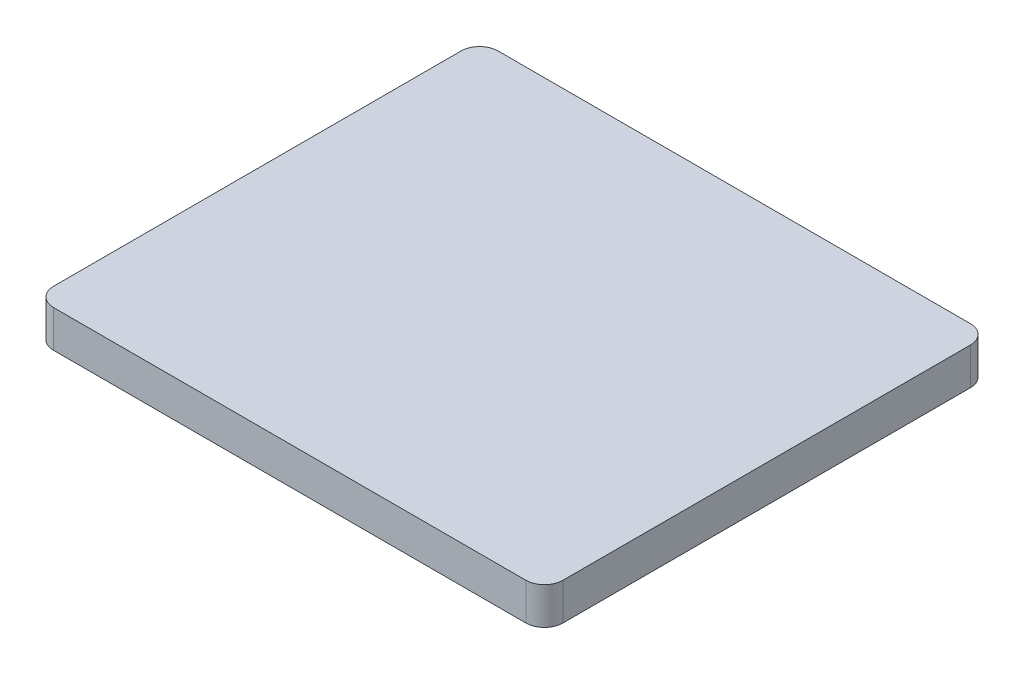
ISO-10303-21;
HEADER;
FILE_DESCRIPTION(('STEP AP214'),'2;1');
FILE_NAME('part.step','',(''),(''),'','','');
FILE_SCHEMA(('AUTOMOTIVE_DESIGN { 1 0 10303 214 1 1 1 1 }'));
ENDSEC;
DATA;
#1=APPLICATION_CONTEXT('core data for automotive mechanical design processes');
#2=APPLICATION_PROTOCOL_DEFINITION('international standard','automotive_design',2000,#1);
#3=PRODUCT_CONTEXT('',#1,'mechanical');
#4=PRODUCT('Part','Part','',(#3));
#5=PRODUCT_RELATED_PRODUCT_CATEGORY('part','',(#4));
#6=PRODUCT_DEFINITION_FORMATION('','',#4);
#7=PRODUCT_DEFINITION_CONTEXT('part definition',#1,'design');
#8=PRODUCT_DEFINITION('design','',#6,#7);
#9=PRODUCT_DEFINITION_SHAPE('','',#8);
#10=(LENGTH_UNIT() NAMED_UNIT(*) SI_UNIT(.MILLI.,.METRE.));
#11=(NAMED_UNIT(*) PLANE_ANGLE_UNIT() SI_UNIT($,.RADIAN.));
#12=(NAMED_UNIT(*) SI_UNIT($,.STERADIAN.) SOLID_ANGLE_UNIT());
#13=UNCERTAINTY_MEASURE_WITH_UNIT(LENGTH_MEASURE(1.E-05),#10,'distance_accuracy_value','');
#14=(GEOMETRIC_REPRESENTATION_CONTEXT(3) GLOBAL_UNCERTAINTY_ASSIGNED_CONTEXT((#13)) GLOBAL_UNIT_ASSIGNED_CONTEXT((#10,
#11,#12)) REPRESENTATION_CONTEXT('',''));
#15=CARTESIAN_POINT('',(0.,0.,0.));
#16=DIRECTION('',(0.,0.,1.));
#17=DIRECTION('',(1.,0.,0.));
#18=AXIS2_PLACEMENT_3D('',#15,#16,#17);
#19=CARTESIAN_POINT('',(275.,40.,-240.));
#20=DIRECTION('',(-1.,0.,0.));
#21=DIRECTION('',(0.,0.,1.));
#22=AXIS2_PLACEMENT_3D('',#19,#20,#21);
#23=PLANE('',#22);
#24=DIRECTION('',(0.,0.,-1.));
#25=VECTOR('',#24,1.);
#26=CARTESIAN_POINT('',(275.,0.,-240.));
#27=LINE('',#26,#25);
#28=CARTESIAN_POINT('',(275.,0.,220.));
#29=VERTEX_POINT('',#28);
#30=CARTESIAN_POINT('',(275.,0.,-220.));
#31=VERTEX_POINT('',#30);
#32=EDGE_CURVE('E140',#29,#31,#27,.T.);
#33=ORIENTED_EDGE('',*,*,#32,.T.);
#34=DIRECTION('',(0.,-1.,0.));
#35=VECTOR('',#34,1.);
#36=CARTESIAN_POINT('',(275.,40.,-220.));
#37=LINE('',#36,#35);
#38=CARTESIAN_POINT('',(275.,40.,-220.));
#39=VERTEX_POINT('',#38);
#40=EDGE_CURVE('E174',#31,#39,#37,.F.);
#41=ORIENTED_EDGE('',*,*,#40,.T.);
#42=DIRECTION('',(0.,0.,-1.));
#43=VECTOR('',#42,1.);
#44=CARTESIAN_POINT('',(275.,40.,-240.));
#45=LINE('',#44,#43);
#46=CARTESIAN_POINT('',(275.,40.,220.));
#47=VERTEX_POINT('',#46);
#48=EDGE_CURVE('E138',#47,#39,#45,.T.);
#49=ORIENTED_EDGE('',*,*,#48,.F.);
#50=DIRECTION('',(0.,-1.,0.));
#51=VECTOR('',#50,1.);
#52=CARTESIAN_POINT('',(275.,40.,220.));
#53=LINE('',#52,#51);
#54=EDGE_CURVE('E170',#47,#29,#53,.T.);
#55=ORIENTED_EDGE('',*,*,#54,.T.);
#56=EDGE_LOOP('',(#33,#41,#49,#55));
#57=FACE_BOUND('',#56,.T.);
#58=ADVANCED_FACE('F39',(#57),#23,.F.);
#59=CARTESIAN_POINT('',(-275.,40.,-240.));
#60=DIRECTION('',(0.,0.,1.));
#61=DIRECTION('',(1.,0.,0.));
#62=AXIS2_PLACEMENT_3D('',#59,#60,#61);
#63=PLANE('',#62);
#64=DIRECTION('',(-1.,0.,0.));
#65=VECTOR('',#64,1.);
#66=CARTESIAN_POINT('',(-275.,0.,-240.));
#67=LINE('',#66,#65);
#68=CARTESIAN_POINT('',(255.,0.,-240.));
#69=VERTEX_POINT('',#68);
#70=CARTESIAN_POINT('',(-255.,0.,-240.));
#71=VERTEX_POINT('',#70);
#72=EDGE_CURVE('E134',#69,#71,#67,.T.);
#73=ORIENTED_EDGE('',*,*,#72,.T.);
#74=DIRECTION('',(0.,-1.,0.));
#75=VECTOR('',#74,1.);
#76=CARTESIAN_POINT('',(-255.,40.,-240.));
#77=LINE('',#76,#75);
#78=CARTESIAN_POINT('',(-255.,40.,-240.));
#79=VERTEX_POINT('',#78);
#80=EDGE_CURVE('E110',#71,#79,#77,.F.);
#81=ORIENTED_EDGE('',*,*,#80,.T.);
#82=DIRECTION('',(-1.,0.,0.));
#83=VECTOR('',#82,1.);
#84=CARTESIAN_POINT('',(-275.,40.,-240.));
#85=LINE('',#84,#83);
#86=CARTESIAN_POINT('',(255.,40.,-240.));
#87=VERTEX_POINT('',#86);
#88=EDGE_CURVE('E193',#87,#79,#85,.T.);
#89=ORIENTED_EDGE('',*,*,#88,.F.);
#90=DIRECTION('',(0.,-1.,0.));
#91=VECTOR('',#90,1.);
#92=CARTESIAN_POINT('',(255.,40.,-240.));
#93=LINE('',#92,#91);
#94=EDGE_CURVE('E116',#87,#69,#93,.T.);
#95=ORIENTED_EDGE('',*,*,#94,.T.);
#96=EDGE_LOOP('',(#73,#81,#89,#95));
#97=FACE_BOUND('',#96,.T.);
#98=ADVANCED_FACE('F214',(#97),#63,.F.);
#99=CARTESIAN_POINT('',(-275.,40.,-240.));
#100=DIRECTION('',(1.,0.,0.));
#101=DIRECTION('',(0.,0.,-1.));
#102=AXIS2_PLACEMENT_3D('',#99,#100,#101);
#103=PLANE('',#102);
#104=DIRECTION('',(0.,0.,1.));
#105=VECTOR('',#104,1.);
#106=CARTESIAN_POINT('',(-275.,40.,-240.));
#107=LINE('',#106,#105);
#108=CARTESIAN_POINT('',(-275.,40.,-220.));
#109=VERTEX_POINT('',#108);
#110=CARTESIAN_POINT('',(-275.,40.,220.));
#111=VERTEX_POINT('',#110);
#112=EDGE_CURVE('E125',#109,#111,#107,.T.);
#113=ORIENTED_EDGE('',*,*,#112,.F.);
#114=DIRECTION('',(0.,-1.,0.));
#115=VECTOR('',#114,1.);
#116=CARTESIAN_POINT('',(-275.,40.,-220.));
#117=LINE('',#116,#115);
#118=CARTESIAN_POINT('',(-275.,0.,-220.));
#119=VERTEX_POINT('',#118);
#120=EDGE_CURVE('E109',#109,#119,#117,.T.);
#121=ORIENTED_EDGE('',*,*,#120,.T.);
#122=DIRECTION('',(0.,0.,1.));
#123=VECTOR('',#122,1.);
#124=CARTESIAN_POINT('',(-275.,0.,-240.));
#125=LINE('',#124,#123);
#126=CARTESIAN_POINT('',(-275.,0.,220.));
#127=VERTEX_POINT('',#126);
#128=EDGE_CURVE('E123',#119,#127,#125,.T.);
#129=ORIENTED_EDGE('',*,*,#128,.T.);
#130=DIRECTION('',(0.,-1.,0.));
#131=VECTOR('',#130,1.);
#132=CARTESIAN_POINT('',(-275.,40.,220.));
#133=LINE('',#132,#131);
#134=EDGE_CURVE('E128',#127,#111,#133,.F.);
#135=ORIENTED_EDGE('',*,*,#134,.T.);
#136=EDGE_LOOP('',(#113,#121,#129,#135));
#137=FACE_BOUND('',#136,.T.);
#138=ADVANCED_FACE('F122',(#137),#103,.F.);
#139=CARTESIAN_POINT('',(-275.,40.,240.));
#140=DIRECTION('',(0.,0.,-1.));
#141=DIRECTION('',(-1.,0.,0.));
#142=AXIS2_PLACEMENT_3D('',#139,#140,#141);
#143=PLANE('',#142);
#144=DIRECTION('',(1.,0.,0.));
#145=VECTOR('',#144,1.);
#146=CARTESIAN_POINT('',(-275.,0.,240.));
#147=LINE('',#146,#145);
#148=CARTESIAN_POINT('',(-255.,0.,240.));
#149=VERTEX_POINT('',#148);
#150=CARTESIAN_POINT('',(255.,0.,240.));
#151=VERTEX_POINT('',#150);
#152=EDGE_CURVE('E133',#149,#151,#147,.T.);
#153=ORIENTED_EDGE('',*,*,#152,.T.);
#154=DIRECTION('',(0.,-1.,0.));
#155=VECTOR('',#154,1.);
#156=CARTESIAN_POINT('',(255.,40.,240.));
#157=LINE('',#156,#155);
#158=CARTESIAN_POINT('',(255.,40.,240.));
#159=VERTEX_POINT('',#158);
#160=EDGE_CURVE('E11',#151,#159,#157,.F.);
#161=ORIENTED_EDGE('',*,*,#160,.T.);
#162=DIRECTION('',(1.,0.,0.));
#163=VECTOR('',#162,1.);
#164=CARTESIAN_POINT('',(-275.,40.,240.));
#165=LINE('',#164,#163);
#166=CARTESIAN_POINT('',(-255.,40.,240.));
#167=VERTEX_POINT('',#166);
#168=EDGE_CURVE('E145',#167,#159,#165,.T.);
#169=ORIENTED_EDGE('',*,*,#168,.F.);
#170=DIRECTION('',(0.,-1.,0.));
#171=VECTOR('',#170,1.);
#172=CARTESIAN_POINT('',(-255.,40.,240.));
#173=LINE('',#172,#171);
#174=EDGE_CURVE('E48',#167,#149,#173,.T.);
#175=ORIENTED_EDGE('',*,*,#174,.T.);
#176=EDGE_LOOP('',(#153,#161,#169,#175));
#177=FACE_BOUND('',#176,.T.);
#178=ADVANCED_FACE('F179',(#177),#143,.F.);
#179=CARTESIAN_POINT('',(0.,40.,0.));
#180=DIRECTION('',(0.,1.,0.));
#181=DIRECTION('',(0.,0.,1.));
#182=AXIS2_PLACEMENT_3D('',#179,#180,#181);
#183=PLANE('',#182);
#184=ORIENTED_EDGE('',*,*,#88,.T.);
#185=CARTESIAN_POINT('',(-255.,40.,-220.));
#186=DIRECTION('',(0.,1.,0.));
#187=DIRECTION('',(0.,0.,1.));
#188=AXIS2_PLACEMENT_3D('',#185,#186,#187);
#189=CIRCLE('',#188,20.);
#190=EDGE_CURVE('E167',#79,#109,#189,.T.);
#191=ORIENTED_EDGE('',*,*,#190,.T.);
#192=ORIENTED_EDGE('',*,*,#112,.T.);
#193=CARTESIAN_POINT('',(-255.,40.,220.));
#194=DIRECTION('',(0.,1.,0.));
#195=DIRECTION('',(0.,0.,1.));
#196=AXIS2_PLACEMENT_3D('',#193,#194,#195);
#197=CIRCLE('',#196,20.);
#198=EDGE_CURVE('E60',#111,#167,#197,.T.);
#199=ORIENTED_EDGE('',*,*,#198,.T.);
#200=ORIENTED_EDGE('',*,*,#168,.T.);
#201=CARTESIAN_POINT('',(255.,40.,220.));
#202=DIRECTION('',(0.,1.,0.));
#203=DIRECTION('',(0.,0.,1.));
#204=AXIS2_PLACEMENT_3D('',#201,#202,#203);
#205=CIRCLE('',#204,20.);
#206=EDGE_CURVE('E161',#159,#47,#205,.T.);
#207=ORIENTED_EDGE('',*,*,#206,.T.);
#208=ORIENTED_EDGE('',*,*,#48,.T.);
#209=CARTESIAN_POINT('',(255.,40.,-220.));
#210=DIRECTION('',(0.,1.,0.));
#211=DIRECTION('',(0.,0.,1.));
#212=AXIS2_PLACEMENT_3D('',#209,#210,#211);
#213=CIRCLE('',#212,20.);
#214=EDGE_CURVE('E164',#39,#87,#213,.T.);
#215=ORIENTED_EDGE('',*,*,#214,.T.);
#216=EDGE_LOOP('',(#184,#191,#192,#199,#200,#207,#208,#215));
#217=FACE_BOUND('',#216,.T.);
#218=ADVANCED_FACE('F203',(#217),#183,.T.);
#219=CARTESIAN_POINT('',(0.,0.,0.));
#220=DIRECTION('',(0.,1.,0.));
#221=DIRECTION('',(0.,0.,1.));
#222=AXIS2_PLACEMENT_3D('',#219,#220,#221);
#223=PLANE('',#222);
#224=ORIENTED_EDGE('',*,*,#128,.F.);
#225=CARTESIAN_POINT('',(-255.,0.,-220.));
#226=DIRECTION('',(0.,1.,0.));
#227=DIRECTION('',(0.,0.,1.));
#228=AXIS2_PLACEMENT_3D('',#225,#226,#227);
#229=CIRCLE('',#228,20.);
#230=EDGE_CURVE('E105',#119,#71,#229,.F.);
#231=ORIENTED_EDGE('',*,*,#230,.T.);
#232=ORIENTED_EDGE('',*,*,#72,.F.);
#233=CARTESIAN_POINT('',(255.,0.,-220.));
#234=DIRECTION('',(0.,1.,0.));
#235=DIRECTION('',(0.,0.,1.));
#236=AXIS2_PLACEMENT_3D('',#233,#234,#235);
#237=CIRCLE('',#236,20.);
#238=EDGE_CURVE('E117',#69,#31,#237,.F.);
#239=ORIENTED_EDGE('',*,*,#238,.T.);
#240=ORIENTED_EDGE('',*,*,#32,.F.);
#241=CARTESIAN_POINT('',(255.,0.,220.));
#242=DIRECTION('',(0.,1.,0.));
#243=DIRECTION('',(0.,0.,1.));
#244=AXIS2_PLACEMENT_3D('',#241,#242,#243);
#245=CIRCLE('',#244,20.);
#246=EDGE_CURVE('E149',#29,#151,#245,.F.);
#247=ORIENTED_EDGE('',*,*,#246,.T.);
#248=ORIENTED_EDGE('',*,*,#152,.F.);
#249=CARTESIAN_POINT('',(-255.,0.,220.));
#250=DIRECTION('',(0.,1.,0.));
#251=DIRECTION('',(0.,0.,1.));
#252=AXIS2_PLACEMENT_3D('',#249,#250,#251);
#253=CIRCLE('',#252,20.);
#254=EDGE_CURVE('E127',#149,#127,#253,.F.);
#255=ORIENTED_EDGE('',*,*,#254,.T.);
#256=EDGE_LOOP('',(#224,#231,#232,#239,#240,#247,#248,#255));
#257=FACE_BOUND('',#256,.T.);
#258=ADVANCED_FACE('F130',(#257),#223,.F.);
#259=CARTESIAN_POINT('',(-255.,40.,-220.));
#260=DIRECTION('',(0.,-1.,0.));
#261=DIRECTION('',(0.,0.,-1.));
#262=AXIS2_PLACEMENT_3D('',#259,#260,#261);
#263=CYLINDRICAL_SURFACE('',#262,20.);
#264=ORIENTED_EDGE('',*,*,#190,.F.);
#265=ORIENTED_EDGE('',*,*,#80,.F.);
#266=ORIENTED_EDGE('',*,*,#230,.F.);
#267=ORIENTED_EDGE('',*,*,#120,.F.);
#268=EDGE_LOOP('',(#264,#265,#266,#267));
#269=FACE_BOUND('',#268,.T.);
#270=ADVANCED_FACE('F108',(#269),#263,.T.);
#271=CARTESIAN_POINT('',(255.,40.,-220.));
#272=DIRECTION('',(0.,-1.,0.));
#273=DIRECTION('',(0.,0.,-1.));
#274=AXIS2_PLACEMENT_3D('',#271,#272,#273);
#275=CYLINDRICAL_SURFACE('',#274,20.);
#276=ORIENTED_EDGE('',*,*,#214,.F.);
#277=ORIENTED_EDGE('',*,*,#40,.F.);
#278=ORIENTED_EDGE('',*,*,#238,.F.);
#279=ORIENTED_EDGE('',*,*,#94,.F.);
#280=EDGE_LOOP('',(#276,#277,#278,#279));
#281=FACE_BOUND('',#280,.T.);
#282=ADVANCED_FACE('F225',(#281),#275,.T.);
#283=CARTESIAN_POINT('',(255.,40.,220.));
#284=DIRECTION('',(0.,-1.,0.));
#285=DIRECTION('',(0.,0.,-1.));
#286=AXIS2_PLACEMENT_3D('',#283,#284,#285);
#287=CYLINDRICAL_SURFACE('',#286,20.);
#288=ORIENTED_EDGE('',*,*,#206,.F.);
#289=ORIENTED_EDGE('',*,*,#160,.F.);
#290=ORIENTED_EDGE('',*,*,#246,.F.);
#291=ORIENTED_EDGE('',*,*,#54,.F.);
#292=EDGE_LOOP('',(#288,#289,#290,#291));
#293=FACE_BOUND('',#292,.T.);
#294=ADVANCED_FACE('F186',(#293),#287,.T.);
#295=CARTESIAN_POINT('',(-255.,40.,220.));
#296=DIRECTION('',(0.,-1.,0.));
#297=DIRECTION('',(0.,0.,-1.));
#298=AXIS2_PLACEMENT_3D('',#295,#296,#297);
#299=CYLINDRICAL_SURFACE('',#298,20.);
#300=ORIENTED_EDGE('',*,*,#198,.F.);
#301=ORIENTED_EDGE('',*,*,#134,.F.);
#302=ORIENTED_EDGE('',*,*,#254,.F.);
#303=ORIENTED_EDGE('',*,*,#174,.F.);
#304=EDGE_LOOP('',(#300,#301,#302,#303));
#305=FACE_BOUND('',#304,.T.);
#306=ADVANCED_FACE('F41',(#305),#299,.T.);
#307=CLOSED_SHELL('',(#58,#98,#138,#178,#218,#258,#270,#282,#294,#306));
#308=MANIFOLD_SOLID_BREP('B2',#307);
#309=ADVANCED_BREP_SHAPE_REPRESENTATION('',(#18,#308),#14);
#310=SHAPE_DEFINITION_REPRESENTATION(#9,#309);
ENDSEC;
END-ISO-10303-21;
